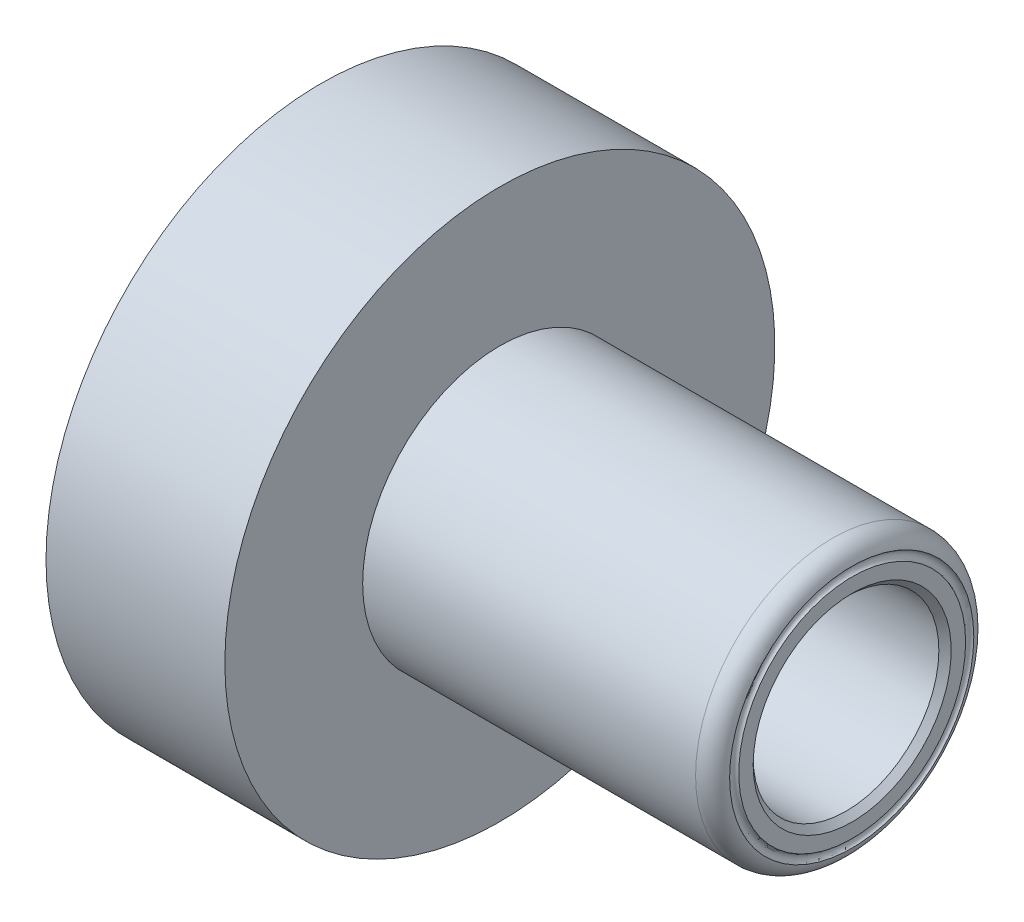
from build123d import *

# Parameters (mm, degrees)
SKETCH2_R          = 3.2004
CUT_EXTRUDE1_DEPTH = 7.9502
SKETCH3_R          = 7.505
CUT_EXTRUDE2_DEPTH = 54.202845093
CHAMFER1_SIZE      = 0.5
SKETCH4_R          = 0.381


with BuildPart() as part:
    # Sketch1 → Revolve1 (revolve)
    with BuildSketch(Plane.XY, mode=Mode.PRIVATE) as revolve1_sk:
        with BuildLine():
            Line((0, 8.128), (0, 22.225))
            Line((0, 22.225), (14.4526, 22.225))
            Line((14.4526, 22.225), (14.4526, 11.0871))
            Line((14.4526, 11.0871), (41.356, 11.0871))
            ThreePointArc((41.356, 11.0871), (42.466157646, 10.627257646), (42.926, 9.5171))
            Line((42.926, 9.5171), (42.926, 0))
            Line((42.926, 0), (28.067, 0))
            Line((28.067, 0), (28.067, 8.128))
            Line((28.067, 8.128), (0, 8.128))
        make_face()
    revolve(revolve1_sk.sketch.rotate(Axis((0, 0, 0), (1, 0, 0)), 90), axis=Axis((0, 0, 0), (1, 0, 0)))

    # Sketch2 → Cut-Extrude1 (cut)
    with BuildSketch(Plane.ZY):
        with Locations((-12.7, 0)):
            Circle(SKETCH2_R)
        with Locations(Location((12.7, 0, 0), (0, 0, 180))):
            Circle(SKETCH2_R)
    extrude(amount=-CUT_EXTRUDE1_DEPTH, mode=Mode.SUBTRACT)

    # Sketch3 → Cut-Extrude2 (cut, through all)
    with BuildSketch(Plane(origin=(42.926, 0, 0), x_dir=(0, 0, -1), z_dir=(1, 0, 0))):
        Circle(SKETCH3_R)
    extrude(amount=-CUT_EXTRUDE2_DEPTH, mode=Mode.SUBTRACT)

    # Chamfer1
    chamfer1_edges = [part.edges().sort_by_distance(p)[0] for p in [
        (42.926, 0, 7.505),
    ]]
    chamfer(chamfer1_edges, length=CHAMFER1_SIZE)

    # Sketch4 → Cut-Revolve1 (revolve, cut)
    with BuildSketch(Plane.XY, mode=Mode.PRIVATE) as cut_revolve1_sk:
        with Locations((43.057, 9.525)):
            Circle(SKETCH4_R)
    revolve(cut_revolve1_sk.sketch.rotate(Axis((0, 0, 0), (1, 0, 0)), 90), axis=Axis((0, 0, 0), (1, 0, 0)), mode=Mode.SUBTRACT)


solid = part.part
